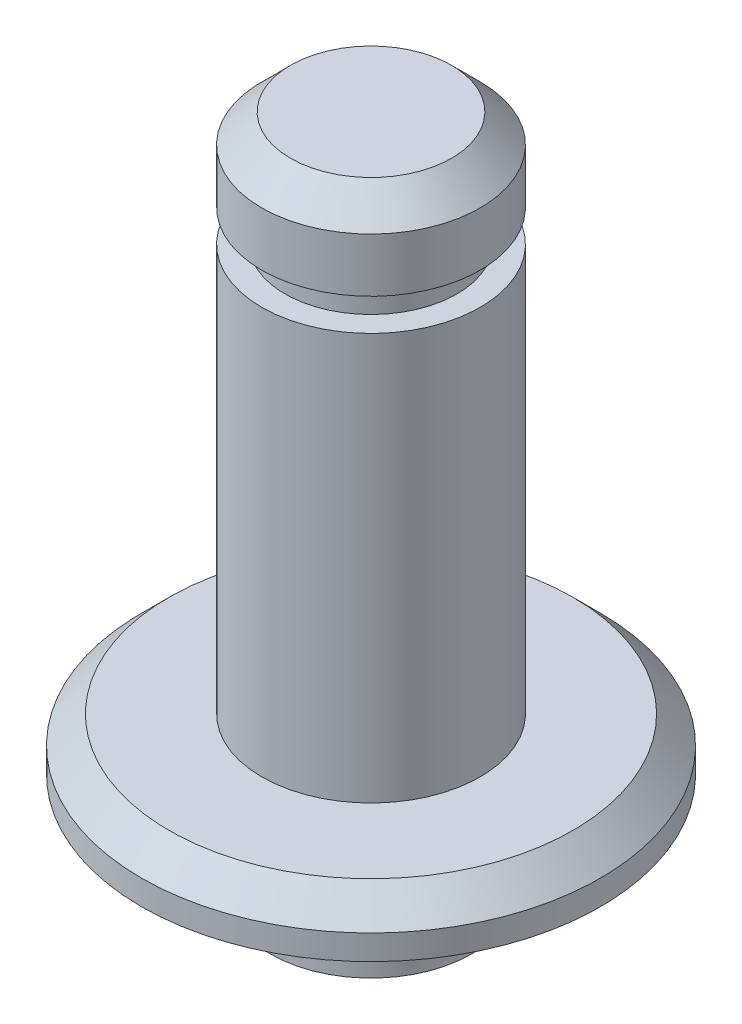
ISO-10303-21;
HEADER;
FILE_DESCRIPTION(('STEP AP214'),'2;1');
FILE_NAME('part.step','',(''),(''),'','','');
FILE_SCHEMA(('AUTOMOTIVE_DESIGN { 1 0 10303 214 1 1 1 1 }'));
ENDSEC;
DATA;
#1=APPLICATION_CONTEXT('core data for automotive mechanical design processes');
#2=APPLICATION_PROTOCOL_DEFINITION('international standard','automotive_design',2000,#1);
#3=PRODUCT_CONTEXT('',#1,'mechanical');
#4=PRODUCT('Part','Part','',(#3));
#5=PRODUCT_RELATED_PRODUCT_CATEGORY('part','',(#4));
#6=PRODUCT_DEFINITION_FORMATION('','',#4);
#7=PRODUCT_DEFINITION_CONTEXT('part definition',#1,'design');
#8=PRODUCT_DEFINITION('design','',#6,#7);
#9=PRODUCT_DEFINITION_SHAPE('','',#8);
#10=(LENGTH_UNIT() NAMED_UNIT(*) SI_UNIT(.MILLI.,.METRE.));
#11=(NAMED_UNIT(*) PLANE_ANGLE_UNIT() SI_UNIT($,.RADIAN.));
#12=(NAMED_UNIT(*) SI_UNIT($,.STERADIAN.) SOLID_ANGLE_UNIT());
#13=UNCERTAINTY_MEASURE_WITH_UNIT(LENGTH_MEASURE(1.E-05),#10,'distance_accuracy_value','');
#14=(GEOMETRIC_REPRESENTATION_CONTEXT(3) GLOBAL_UNCERTAINTY_ASSIGNED_CONTEXT((#13)) GLOBAL_UNIT_ASSIGNED_CONTEXT((#10,
#11,#12)) REPRESENTATION_CONTEXT('',''));
#15=CARTESIAN_POINT('',(0.,0.,0.));
#16=DIRECTION('',(0.,0.,1.));
#17=DIRECTION('',(1.,0.,0.));
#18=AXIS2_PLACEMENT_3D('',#15,#16,#17);
#19=CARTESIAN_POINT('',(0.,0.,0.));
#20=DIRECTION('',(0.,-1.,0.));
#21=DIRECTION('',(0.,0.,-1.));
#22=AXIS2_PLACEMENT_3D('',#19,#20,#21);
#23=CYLINDRICAL_SURFACE('',#22,3.0226);
#24=CARTESIAN_POINT('',(0.,12.7,0.));
#25=DIRECTION('',(0.,-1.,0.));
#26=DIRECTION('',(0.,0.,-1.));
#27=AXIS2_PLACEMENT_3D('',#24,#25,#26);
#28=CIRCLE('',#27,3.0226);
#29=CARTESIAN_POINT('',(0.,12.7,-3.0226));
#30=VERTEX_POINT('',#29);
#31=EDGE_CURVE('E64',#30,#30,#28,.T.);
#32=ORIENTED_EDGE('',*,*,#31,.T.);
#33=EDGE_LOOP('',(#32));
#34=FACE_BOUND('',#33,.T.);
#35=CARTESIAN_POINT('',(0.,1.4478,0.));
#36=DIRECTION('',(0.,-1.,0.));
#37=DIRECTION('',(0.,0.,-1.));
#38=AXIS2_PLACEMENT_3D('',#35,#36,#37);
#39=CIRCLE('',#38,3.0226);
#40=CARTESIAN_POINT('',(0.,1.4478,-3.0226));
#41=VERTEX_POINT('',#40);
#42=EDGE_CURVE('E58',#41,#41,#39,.T.);
#43=ORIENTED_EDGE('',*,*,#42,.F.);
#44=EDGE_LOOP('',(#43));
#45=FACE_BOUND('',#44,.T.);
#46=ADVANCED_FACE('F32',(#34,#45),#23,.T.);
#47=CARTESIAN_POINT('',(0.,0.,0.));
#48=DIRECTION('',(0.,-1.,0.));
#49=DIRECTION('',(0.,0.,-1.));
#50=AXIS2_PLACEMENT_3D('',#47,#48,#49);
#51=CYLINDRICAL_SURFACE('',#50,2.778125);
#52=CARTESIAN_POINT('',(0.,0.,0.));
#53=DIRECTION('',(0.,-1.,0.));
#54=DIRECTION('',(0.,0.,-1.));
#55=AXIS2_PLACEMENT_3D('',#52,#53,#54);
#56=CIRCLE('',#55,2.778125);
#57=CARTESIAN_POINT('',(0.,0.,-2.778125));
#58=VERTEX_POINT('',#57);
#59=EDGE_CURVE('E52',#58,#58,#56,.T.);
#60=ORIENTED_EDGE('',*,*,#59,.T.);
#61=EDGE_LOOP('',(#60));
#62=FACE_BOUND('',#61,.T.);
#63=CARTESIAN_POINT('',(0.,-2.921,0.));
#64=DIRECTION('',(0.,-1.,0.));
#65=DIRECTION('',(0.,0.,-1.));
#66=AXIS2_PLACEMENT_3D('',#63,#64,#65);
#67=CIRCLE('',#66,2.778125);
#68=CARTESIAN_POINT('',(0.,-2.921,-2.778125));
#69=VERTEX_POINT('',#68);
#70=EDGE_CURVE('E61',#69,#69,#67,.T.);
#71=ORIENTED_EDGE('',*,*,#70,.F.);
#72=EDGE_LOOP('',(#71));
#73=FACE_BOUND('',#72,.T.);
#74=ADVANCED_FACE('F98',(#62,#73),#51,.T.);
#75=CARTESIAN_POINT('',(0.,0.,-2.778125));
#76=DIRECTION('',(0.,-1.,0.));
#77=DIRECTION('',(0.,0.,-1.));
#78=AXIS2_PLACEMENT_3D('',#75,#76,#77);
#79=PLANE('',#78);
#80=CARTESIAN_POINT('',(0.,0.,0.));
#81=DIRECTION('',(0.,-1.,0.));
#82=DIRECTION('',(0.,0.,-1.));
#83=AXIS2_PLACEMENT_3D('',#80,#81,#82);
#84=CIRCLE('',#83,6.35);
#85=CARTESIAN_POINT('',(0.,0.,-6.35));
#86=VERTEX_POINT('',#85);
#87=EDGE_CURVE('E55',#86,#86,#84,.T.);
#88=ORIENTED_EDGE('',*,*,#87,.T.);
#89=EDGE_LOOP('',(#88));
#90=FACE_BOUND('',#89,.T.);
#91=ORIENTED_EDGE('',*,*,#59,.F.);
#92=EDGE_LOOP('',(#91));
#93=FACE_BOUND('',#92,.T.);
#94=ADVANCED_FACE('F105',(#90,#93),#79,.T.);
#95=CARTESIAN_POINT('',(0.,0.,0.));
#96=DIRECTION('',(0.,-1.,0.));
#97=DIRECTION('',(0.,0.,-1.));
#98=AXIS2_PLACEMENT_3D('',#95,#96,#97);
#99=CYLINDRICAL_SURFACE('',#98,6.35);
#100=CARTESIAN_POINT('',(0.,0.685800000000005,0.));
#101=DIRECTION('',(0.,1.,0.));
#102=DIRECTION('',(0.,0.,1.));
#103=AXIS2_PLACEMENT_3D('',#100,#101,#102);
#104=CIRCLE('',#103,6.35);
#105=CARTESIAN_POINT('',(0.,0.685800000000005,-6.35));
#106=VERTEX_POINT('',#105);
#107=EDGE_CURVE('E39',#106,#106,#104,.F.);
#108=ORIENTED_EDGE('',*,*,#107,.T.);
#109=EDGE_LOOP('',(#108));
#110=FACE_BOUND('',#109,.T.);
#111=ORIENTED_EDGE('',*,*,#87,.F.);
#112=EDGE_LOOP('',(#111));
#113=FACE_BOUND('',#112,.T.);
#114=ADVANCED_FACE('F114',(#110,#113),#99,.T.);
#115=CARTESIAN_POINT('',(0.,1.4478,-6.35));
#116=DIRECTION('',(0.,1.,0.));
#117=DIRECTION('',(0.,0.,1.));
#118=AXIS2_PLACEMENT_3D('',#115,#116,#117);
#119=PLANE('',#118);
#120=CARTESIAN_POINT('',(0.,1.4478,0.));
#121=DIRECTION('',(0.,1.,0.));
#122=DIRECTION('',(0.,0.,1.));
#123=AXIS2_PLACEMENT_3D('',#120,#121,#122);
#124=CIRCLE('',#123,5.588);
#125=CARTESIAN_POINT('',(0.,1.4478,-5.588));
#126=VERTEX_POINT('',#125);
#127=EDGE_CURVE('E10',#126,#126,#124,.T.);
#128=ORIENTED_EDGE('',*,*,#127,.T.);
#129=EDGE_LOOP('',(#128));
#130=FACE_BOUND('',#129,.T.);
#131=ORIENTED_EDGE('',*,*,#42,.T.);
#132=EDGE_LOOP('',(#131));
#133=FACE_BOUND('',#132,.T.);
#134=ADVANCED_FACE('F110',(#130,#133),#119,.T.);
#135=CARTESIAN_POINT('',(0.,-2.921,0.));
#136=DIRECTION('',(0.,-1.,0.));
#137=DIRECTION('',(0.,0.,-1.));
#138=AXIS2_PLACEMENT_3D('',#135,#136,#137);
#139=PLANE('',#138);
#140=ORIENTED_EDGE('',*,*,#70,.T.);
#141=EDGE_LOOP('',(#140));
#142=FACE_BOUND('',#141,.T.);
#143=ADVANCED_FACE('F113',(#142),#139,.T.);
#144=CARTESIAN_POINT('',(0.,0.685800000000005,0.));
#145=DIRECTION('',(0.,-1.,0.));
#146=DIRECTION('',(0.,0.,-1.));
#147=AXIS2_PLACEMENT_3D('',#144,#145,#146);
#148=CONICAL_SURFACE('',#147,6.35,0.785398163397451);
#149=CARTESIAN_POINT('',(0.,1.4478,-5.588));
#150=CARTESIAN_POINT('',(0.,1.4398625,-5.5959375));
#151=CARTESIAN_POINT('',(0.,1.431925,-5.603875));
#152=CARTESIAN_POINT('',(0.,1.41605,-5.61975));
#153=CARTESIAN_POINT('',(0.,1.4081125,-5.6276875));
#154=CARTESIAN_POINT('',(0.,1.3922375,-5.6435625));
#155=CARTESIAN_POINT('',(0.,1.3843,-5.6515));
#156=CARTESIAN_POINT('',(0.,1.368425,-5.667375));
#157=CARTESIAN_POINT('',(0.,1.3604875,-5.6753125));
#158=CARTESIAN_POINT('',(0.,1.3446125,-5.6911875));
#159=CARTESIAN_POINT('',(0.,1.336675,-5.699125));
#160=CARTESIAN_POINT('',(0.,1.3208,-5.715));
#161=CARTESIAN_POINT('',(0.,1.3128625,-5.7229375));
#162=CARTESIAN_POINT('',(0.,1.2969875,-5.7388125));
#163=CARTESIAN_POINT('',(0.,1.28905,-5.74675));
#164=CARTESIAN_POINT('',(0.,1.273175,-5.762625));
#165=CARTESIAN_POINT('',(0.,1.2652375,-5.7705625));
#166=CARTESIAN_POINT('',(0.,1.2493625,-5.7864375));
#167=CARTESIAN_POINT('',(0.,1.241425,-5.794375));
#168=CARTESIAN_POINT('',(0.,1.22555,-5.81025));
#169=CARTESIAN_POINT('',(0.,1.2176125,-5.8181875));
#170=CARTESIAN_POINT('',(0.,1.2017375,-5.8340625));
#171=CARTESIAN_POINT('',(0.,1.1938,-5.842));
#172=CARTESIAN_POINT('',(0.,1.177925,-5.857875));
#173=CARTESIAN_POINT('',(0.,1.1699875,-5.8658125));
#174=CARTESIAN_POINT('',(0.,1.1541125,-5.8816875));
#175=CARTESIAN_POINT('',(0.,1.146175,-5.889625));
#176=CARTESIAN_POINT('',(0.,1.1303,-5.9055));
#177=CARTESIAN_POINT('',(0.,1.1223625,-5.9134375));
#178=CARTESIAN_POINT('',(0.,1.1064875,-5.9293125));
#179=CARTESIAN_POINT('',(0.,1.09855,-5.93725));
#180=CARTESIAN_POINT('',(0.,1.082675,-5.953125));
#181=CARTESIAN_POINT('',(0.,1.0747375,-5.9610625));
#182=CARTESIAN_POINT('',(0.,1.0588625,-5.9769375));
#183=CARTESIAN_POINT('',(0.,1.050925,-5.984875));
#184=CARTESIAN_POINT('',(0.,1.03505,-6.00075));
#185=CARTESIAN_POINT('',(0.,1.0271125,-6.0086875));
#186=CARTESIAN_POINT('',(0.,1.0112375,-6.0245625));
#187=CARTESIAN_POINT('',(0.,1.0033,-6.0325));
#188=CARTESIAN_POINT('',(0.,0.987425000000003,-6.048375));
#189=CARTESIAN_POINT('',(0.,0.979487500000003,-6.0563125));
#190=CARTESIAN_POINT('',(0.,0.963612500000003,-6.0721875));
#191=CARTESIAN_POINT('',(0.,0.955675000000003,-6.080125));
#192=CARTESIAN_POINT('',(0.,0.939800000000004,-6.096));
#193=CARTESIAN_POINT('',(0.,0.931862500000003,-6.1039375));
#194=CARTESIAN_POINT('',(0.,0.915987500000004,-6.1198125));
#195=CARTESIAN_POINT('',(0.,0.908050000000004,-6.12775));
#196=CARTESIAN_POINT('',(0.,0.892175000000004,-6.143625));
#197=CARTESIAN_POINT('',(0.,0.884237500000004,-6.1515625));
#198=CARTESIAN_POINT('',(0.,0.868362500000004,-6.1674375));
#199=CARTESIAN_POINT('',(0.,0.860425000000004,-6.175375));
#200=CARTESIAN_POINT('',(0.,0.844550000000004,-6.19125));
#201=CARTESIAN_POINT('',(0.,0.836612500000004,-6.1991875));
#202=CARTESIAN_POINT('',(0.,0.820737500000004,-6.2150625));
#203=CARTESIAN_POINT('',(0.,0.812800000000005,-6.223));
#204=CARTESIAN_POINT('',(0.,0.796925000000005,-6.238875));
#205=CARTESIAN_POINT('',(0.,0.788987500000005,-6.2468125));
#206=CARTESIAN_POINT('',(0.,0.773112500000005,-6.2626875));
#207=CARTESIAN_POINT('',(0.,0.765175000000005,-6.270625));
#208=CARTESIAN_POINT('',(0.,0.749300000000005,-6.2865));
#209=CARTESIAN_POINT('',(0.,0.741362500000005,-6.2944375));
#210=CARTESIAN_POINT('',(0.,0.725487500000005,-6.3103125));
#211=CARTESIAN_POINT('',(0.,0.717550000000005,-6.31825));
#212=CARTESIAN_POINT('',(0.,0.701675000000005,-6.334125));
#213=CARTESIAN_POINT('',(0.,0.693737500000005,-6.3420625));
#214=CARTESIAN_POINT('',(0.,0.685800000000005,-6.35));
#215=B_SPLINE_CURVE_WITH_KNOTS('',3,(#149,#150,#151,#152,#153,#154,#155,#156,#157,#158,#159,
#160,#161,#162,#163,#164,#165,#166,#167,#168,#169,#170,#171,#172,#173,#174,#175,#176,#177,#178,
#179,#180,#181,#182,#183,#184,#185,#186,#187,#188,#189,#190,#191,#192,#193,#194,#195,#196,#197,
#198,#199,#200,#201,#202,#203,#204,#205,#206,#207,#208,#209,#210,#211,#212,#213,#214),
.UNSPECIFIED.,.F.,.F.,(4,2,2,2,2,2,2,2,2,2,2,2,2,2,2,2,2,2,2,2,2,2,2,2,2,2,2,2,2,2,2,2,4),(0.,
0.0336759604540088,0.0673519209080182,0.101027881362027,0.134703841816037,0.168379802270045,
0.202055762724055,0.235731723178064,0.269407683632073,0.303083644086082,0.336759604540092,
0.3704355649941,0.40411152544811,0.437787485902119,0.471463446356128,0.505139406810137,
0.538815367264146,0.572491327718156,0.606167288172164,0.639843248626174,0.673519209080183,
0.707195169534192,0.740871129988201,0.774547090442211,0.808223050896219,0.841899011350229,
0.875574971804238,0.909250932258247,0.942926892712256,0.976602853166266,1.01027881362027,
1.04395477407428,1.07763073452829),.UNSPECIFIED.);
#216=EDGE_CURVE('BSEAM34',#126,#106,#215,.T.);
#217=ORIENTED_EDGE('',*,*,#127,.F.);
#218=ORIENTED_EDGE('',*,*,#107,.F.);
#219=ORIENTED_EDGE('',*,*,#216,.T.);
#220=ORIENTED_EDGE('',*,*,#216,.F.);
#221=EDGE_LOOP('',(#217,#219,#218,#220));
#222=FACE_BOUND('',#221,.T.);
#223=ADVANCED_FACE('F34',(#222),#148,.T.);
#224=CARTESIAN_POINT('',(0.,12.7,-3.0226));
#225=DIRECTION('',(0.,-1.,0.));
#226=DIRECTION('',(0.,0.,-1.));
#227=AXIS2_PLACEMENT_3D('',#224,#225,#226);
#228=PLANE('',#227);
#229=ORIENTED_EDGE('',*,*,#31,.F.);
#230=EDGE_LOOP('',(#229));
#231=FACE_BOUND('',#230,.T.);
#232=CARTESIAN_POINT('',(0.,12.7,0.));
#233=DIRECTION('',(0.,-1.,0.));
#234=DIRECTION('',(0.,0.,-1.));
#235=AXIS2_PLACEMENT_3D('',#232,#233,#234);
#236=CIRCLE('',#235,2.38125);
#237=CARTESIAN_POINT('',(0.,12.7,-2.38125));
#238=VERTEX_POINT('',#237);
#239=EDGE_CURVE('E67',#238,#238,#236,.T.);
#240=ORIENTED_EDGE('',*,*,#239,.T.);
#241=EDGE_LOOP('',(#240));
#242=FACE_BOUND('',#241,.T.);
#243=ADVANCED_FACE('F134',(#231,#242),#228,.F.);
#244=CARTESIAN_POINT('',(0.,0.,0.));
#245=DIRECTION('',(0.,-1.,0.));
#246=DIRECTION('',(0.,0.,-1.));
#247=AXIS2_PLACEMENT_3D('',#244,#245,#246);
#248=CYLINDRICAL_SURFACE('',#247,2.38125);
#249=ORIENTED_EDGE('',*,*,#239,.F.);
#250=EDGE_LOOP('',(#249));
#251=FACE_BOUND('',#250,.T.);
#252=CARTESIAN_POINT('',(0.,13.589,0.));
#253=DIRECTION('',(0.,-1.,0.));
#254=DIRECTION('',(0.,0.,-1.));
#255=AXIS2_PLACEMENT_3D('',#252,#253,#254);
#256=CIRCLE('',#255,2.38125);
#257=CARTESIAN_POINT('',(0.,13.589,-2.38125));
#258=VERTEX_POINT('',#257);
#259=EDGE_CURVE('E70',#258,#258,#256,.T.);
#260=ORIENTED_EDGE('',*,*,#259,.T.);
#261=EDGE_LOOP('',(#260));
#262=FACE_BOUND('',#261,.T.);
#263=ADVANCED_FACE('F139',(#251,#262),#248,.T.);
#264=CARTESIAN_POINT('',(0.,13.589,-3.0226));
#265=DIRECTION('',(0.,1.,0.));
#266=DIRECTION('',(0.,0.,1.));
#267=AXIS2_PLACEMENT_3D('',#264,#265,#266);
#268=PLANE('',#267);
#269=ORIENTED_EDGE('',*,*,#259,.F.);
#270=EDGE_LOOP('',(#269));
#271=FACE_BOUND('',#270,.T.);
#272=CARTESIAN_POINT('',(0.,13.589,0.));
#273=DIRECTION('',(0.,-1.,0.));
#274=DIRECTION('',(0.,0.,-1.));
#275=AXIS2_PLACEMENT_3D('',#272,#273,#274);
#276=CIRCLE('',#275,3.0226);
#277=CARTESIAN_POINT('',(0.,13.589,-3.0226));
#278=VERTEX_POINT('',#277);
#279=EDGE_CURVE('E73',#278,#278,#276,.T.);
#280=ORIENTED_EDGE('',*,*,#279,.T.);
#281=EDGE_LOOP('',(#280));
#282=FACE_BOUND('',#281,.T.);
#283=ADVANCED_FACE('F77',(#271,#282),#268,.F.);
#284=CARTESIAN_POINT('',(0.,15.875,-3.0226));
#285=DIRECTION('',(0.,1.,0.));
#286=DIRECTION('',(0.,0.,1.));
#287=AXIS2_PLACEMENT_3D('',#284,#285,#286);
#288=PLANE('',#287);
#289=CARTESIAN_POINT('',(0.,15.875,0.));
#290=DIRECTION('',(0.,1.,0.));
#291=DIRECTION('',(0.,0.,1.));
#292=AXIS2_PLACEMENT_3D('',#289,#290,#291);
#293=CIRCLE('',#292,2.22885);
#294=CARTESIAN_POINT('',(0.,15.875,2.22885));
#295=VERTEX_POINT('',#294);
#296=EDGE_CURVE('E43',#295,#295,#293,.T.);
#297=ORIENTED_EDGE('',*,*,#296,.T.);
#298=EDGE_LOOP('',(#297));
#299=FACE_BOUND('',#298,.T.);
#300=ADVANCED_FACE('F87',(#299),#288,.T.);
#301=CARTESIAN_POINT('',(0.,15.08125,0.));
#302=DIRECTION('',(0.,-1.,0.));
#303=DIRECTION('',(0.,0.,-1.));
#304=AXIS2_PLACEMENT_3D('',#301,#302,#303);
#305=CONICAL_SURFACE('',#304,3.0226,0.785398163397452);
#306=ORIENTED_EDGE('',*,*,#296,.F.);
#307=EDGE_LOOP('',(#306));
#308=FACE_BOUND('',#307,.T.);
#309=CARTESIAN_POINT('',(0.,15.08125,0.));
#310=DIRECTION('',(0.,1.,0.));
#311=DIRECTION('',(0.,0.,1.));
#312=AXIS2_PLACEMENT_3D('',#309,#310,#311);
#313=CIRCLE('',#312,3.0226);
#314=CARTESIAN_POINT('',(0.,15.08125,3.0226));
#315=VERTEX_POINT('',#314);
#316=EDGE_CURVE('E47',#315,#315,#313,.F.);
#317=ORIENTED_EDGE('',*,*,#316,.F.);
#318=EDGE_LOOP('',(#317));
#319=FACE_BOUND('',#318,.T.);
#320=ADVANCED_FACE('F82',(#308,#319),#305,.T.);
#321=ORIENTED_EDGE('',*,*,#279,.F.);
#322=EDGE_LOOP('',(#321));
#323=FACE_BOUND('',#322,.T.);
#324=ORIENTED_EDGE('',*,*,#316,.T.);
#325=EDGE_LOOP('',(#324));
#326=FACE_BOUND('',#325,.T.);
#327=ADVANCED_FACE('F79',(#323,#326),#23,.T.);
#328=CLOSED_SHELL('',(#46,#74,#94,#114,#134,#143,#223,#243,#263,#283,#300,#320,#327));
#329=MANIFOLD_SOLID_BREP('B2',#328);
#330=ADVANCED_BREP_SHAPE_REPRESENTATION('',(#18,#329),#14);
#331=SHAPE_DEFINITION_REPRESENTATION(#9,#330);
ENDSEC;
END-ISO-10303-21;
